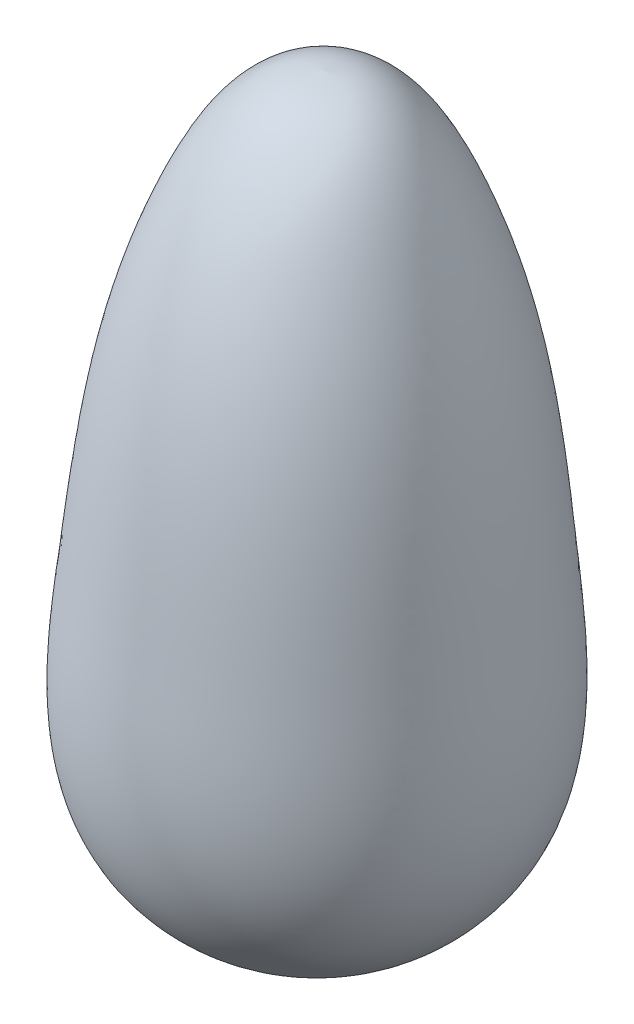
ISO-10303-21;
HEADER;
FILE_DESCRIPTION(('STEP AP214'),'2;1');
FILE_NAME('part.step','',(''),(''),'','','');
FILE_SCHEMA(('AUTOMOTIVE_DESIGN { 1 0 10303 214 1 1 1 1 }'));
ENDSEC;
DATA;
#1=APPLICATION_CONTEXT('core data for automotive mechanical design processes');
#2=APPLICATION_PROTOCOL_DEFINITION('international standard','automotive_design',2000,#1);
#3=PRODUCT_CONTEXT('',#1,'mechanical');
#4=PRODUCT('Part','Part','',(#3));
#5=PRODUCT_RELATED_PRODUCT_CATEGORY('part','',(#4));
#6=PRODUCT_DEFINITION_FORMATION('','',#4);
#7=PRODUCT_DEFINITION_CONTEXT('part definition',#1,'design');
#8=PRODUCT_DEFINITION('design','',#6,#7);
#9=PRODUCT_DEFINITION_SHAPE('','',#8);
#10=(LENGTH_UNIT() NAMED_UNIT(*) SI_UNIT(.MILLI.,.METRE.));
#11=(NAMED_UNIT(*) PLANE_ANGLE_UNIT() SI_UNIT($,.RADIAN.));
#12=(NAMED_UNIT(*) SI_UNIT($,.STERADIAN.) SOLID_ANGLE_UNIT());
#13=UNCERTAINTY_MEASURE_WITH_UNIT(LENGTH_MEASURE(1.E-05),#10,'distance_accuracy_value','');
#14=(GEOMETRIC_REPRESENTATION_CONTEXT(3) GLOBAL_UNCERTAINTY_ASSIGNED_CONTEXT((#13)) GLOBAL_UNIT_ASSIGNED_CONTEXT((#10,
#11,#12)) REPRESENTATION_CONTEXT('',''));
#15=CARTESIAN_POINT('',(0.,0.,0.));
#16=DIRECTION('',(0.,0.,1.));
#17=DIRECTION('',(1.,0.,0.));
#18=AXIS2_PLACEMENT_3D('',#15,#16,#17);
#19=CARTESIAN_POINT('',(0.,46.6650898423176,0.));
#20=CARTESIAN_POINT('',(-1.03289166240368,46.5892515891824,0.));
#21=CARTESIAN_POINT('',(-8.10784292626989,46.0697857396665,0.));
#22=CARTESIAN_POINT('',(-19.8319446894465,25.0658034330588,0.));
#23=CARTESIAN_POINT('',(-22.6854813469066,-0.743230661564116,0.));
#24=CARTESIAN_POINT('',(-26.3874946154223,-30.920693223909,0.));
#25=CARTESIAN_POINT('',(-12.037364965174,-43.5546459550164,0.));
#26=CARTESIAN_POINT('',(-4.32216246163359,-44.1459448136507,0.));
#27=CARTESIAN_POINT('',(-1.3053171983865,-44.3771580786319,0.));
#28=B_SPLINE_CURVE_WITH_KNOTS('',3,(#19,#20,#21,#22,#23,#24,#25,#26,#27),.UNSPECIFIED.,.F.,.F.,
(4,1,1,1,1,1,4),(0.,0.0273864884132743,0.187587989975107,0.539337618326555,0.794528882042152,
0.919655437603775,1.),.UNSPECIFIED.);
#29=CARTESIAN_POINT('',(0.,46.6650898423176,0.));
#30=DIRECTION('',(0.0143360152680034,0.999897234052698,0.));
#31=AXIS1_PLACEMENT('',#29,#30);
#32=SURFACE_OF_REVOLUTION('',#28,#31);
#33=CARTESIAN_POINT('',(-1.3053171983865,-44.3771580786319,0.));
#34=VERTEX_POINT('',#33);
#35=VERTEX_LOOP('',#34);
#36=FACE_BOUND('',#35,.T.);
#37=CARTESIAN_POINT('',(0.,46.6650898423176,0.));
#38=VERTEX_POINT('',#37);
#39=VERTEX_LOOP('',#38);
#40=FACE_BOUND('',#39,.T.);
#41=ADVANCED_FACE('F25',(#36,#40),#32,.F.);
#42=CLOSED_SHELL('',(#41));
#43=MANIFOLD_SOLID_BREP('B2',#42);
#44=ADVANCED_BREP_SHAPE_REPRESENTATION('',(#18,#43),#14);
#45=SHAPE_DEFINITION_REPRESENTATION(#9,#44);
ENDSEC;
END-ISO-10303-21;
